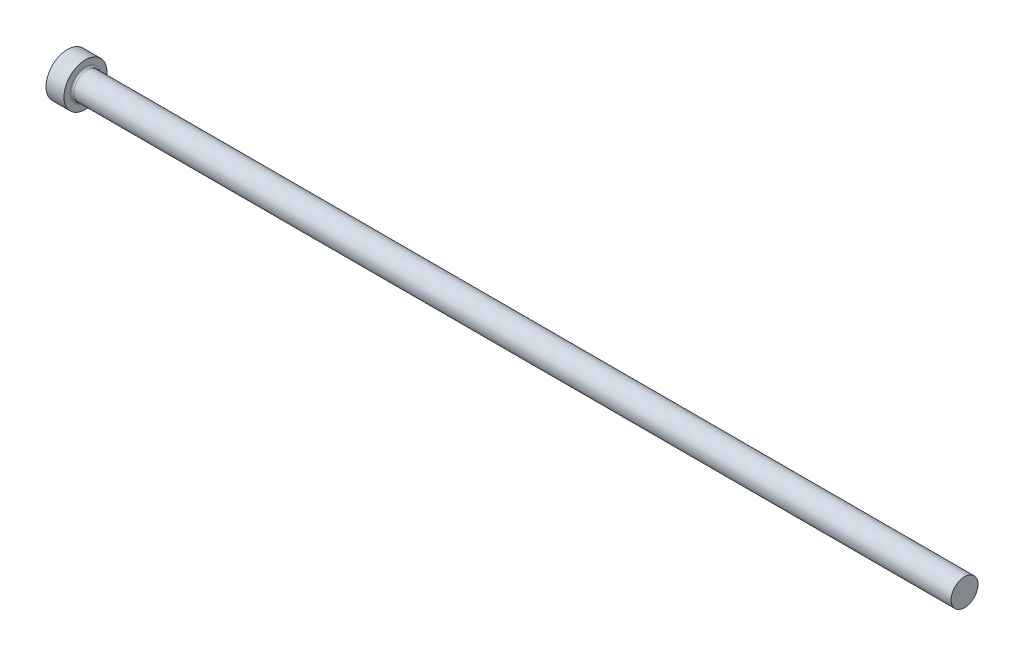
ISO-10303-21;
HEADER;
FILE_DESCRIPTION(('STEP AP214'),'2;1');
FILE_NAME('part.step','',(''),(''),'','','');
FILE_SCHEMA(('AUTOMOTIVE_DESIGN { 1 0 10303 214 1 1 1 1 }'));
ENDSEC;
DATA;
#1=APPLICATION_CONTEXT('core data for automotive mechanical design processes');
#2=APPLICATION_PROTOCOL_DEFINITION('international standard','automotive_design',2000,#1);
#3=PRODUCT_CONTEXT('',#1,'mechanical');
#4=PRODUCT('Part','Part','',(#3));
#5=PRODUCT_RELATED_PRODUCT_CATEGORY('part','',(#4));
#6=PRODUCT_DEFINITION_FORMATION('','',#4);
#7=PRODUCT_DEFINITION_CONTEXT('part definition',#1,'design');
#8=PRODUCT_DEFINITION('design','',#6,#7);
#9=PRODUCT_DEFINITION_SHAPE('','',#8);
#10=(LENGTH_UNIT() NAMED_UNIT(*) SI_UNIT(.MILLI.,.METRE.));
#11=(NAMED_UNIT(*) PLANE_ANGLE_UNIT() SI_UNIT($,.RADIAN.));
#12=(NAMED_UNIT(*) SI_UNIT($,.STERADIAN.) SOLID_ANGLE_UNIT());
#13=UNCERTAINTY_MEASURE_WITH_UNIT(LENGTH_MEASURE(1.E-05),#10,'distance_accuracy_value','');
#14=(GEOMETRIC_REPRESENTATION_CONTEXT(3) GLOBAL_UNCERTAINTY_ASSIGNED_CONTEXT((#13)) GLOBAL_UNIT_ASSIGNED_CONTEXT((#10,
#11,#12)) REPRESENTATION_CONTEXT('',''));
#15=CARTESIAN_POINT('',(0.,0.,0.));
#16=DIRECTION('',(0.,0.,1.));
#17=DIRECTION('',(1.,0.,0.));
#18=AXIS2_PLACEMENT_3D('',#15,#16,#17);
#19=CARTESIAN_POINT('',(0.,0.,0.));
#20=DIRECTION('',(-1.,0.,0.));
#21=DIRECTION('',(0.,-1.,0.));
#22=AXIS2_PLACEMENT_3D('',#19,#20,#21);
#23=PLANE('',#22);
#24=CARTESIAN_POINT('',(0.,0.,0.));
#25=DIRECTION('',(1.,0.,0.));
#26=DIRECTION('',(0.,1.,0.));
#27=AXIS2_PLACEMENT_3D('',#24,#25,#26);
#28=CIRCLE('',#27,6.);
#29=CARTESIAN_POINT('',(0.,6.,0.));
#30=VERTEX_POINT('',#29);
#31=EDGE_CURVE('E25',#30,#30,#28,.T.);
#32=ORIENTED_EDGE('',*,*,#31,.F.);
#33=EDGE_LOOP('',(#32));
#34=FACE_BOUND('',#33,.T.);
#35=ADVANCED_FACE('F14',(#34),#23,.T.);
#36=CARTESIAN_POINT('',(250.,0.,0.));
#37=DIRECTION('',(1.,0.,0.));
#38=DIRECTION('',(0.,1.,0.));
#39=AXIS2_PLACEMENT_3D('',#36,#37,#38);
#40=CYLINDRICAL_SURFACE('',#39,6.);
#41=ORIENTED_EDGE('',*,*,#31,.T.);
#42=EDGE_LOOP('',(#41));
#43=FACE_BOUND('',#42,.T.);
#44=CARTESIAN_POINT('',(5.,0.,0.));
#45=DIRECTION('',(1.,0.,0.));
#46=DIRECTION('',(0.,1.,0.));
#47=AXIS2_PLACEMENT_3D('',#44,#45,#46);
#48=CIRCLE('',#47,6.);
#49=CARTESIAN_POINT('',(5.,6.,0.));
#50=VERTEX_POINT('',#49);
#51=EDGE_CURVE('E29',#50,#50,#48,.T.);
#52=ORIENTED_EDGE('',*,*,#51,.F.);
#53=EDGE_LOOP('',(#52));
#54=FACE_BOUND('',#53,.T.);
#55=ADVANCED_FACE('F51',(#43,#54),#40,.T.);
#56=CARTESIAN_POINT('',(5.,6.,0.));
#57=DIRECTION('',(1.,0.,0.));
#58=DIRECTION('',(0.,1.,0.));
#59=AXIS2_PLACEMENT_3D('',#56,#57,#58);
#60=PLANE('',#59);
#61=CARTESIAN_POINT('',(5.,0.,0.));
#62=DIRECTION('',(1.,0.,0.));
#63=DIRECTION('',(0.,1.,0.));
#64=AXIS2_PLACEMENT_3D('',#61,#62,#63);
#65=CIRCLE('',#64,4.24999999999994);
#66=CARTESIAN_POINT('',(5.,4.24999999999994,0.));
#67=VERTEX_POINT('',#66);
#68=EDGE_CURVE('E9',#67,#67,#65,.F.);
#69=ORIENTED_EDGE('',*,*,#68,.T.);
#70=EDGE_LOOP('',(#69));
#71=FACE_BOUND('',#70,.T.);
#72=ORIENTED_EDGE('',*,*,#51,.T.);
#73=EDGE_LOOP('',(#72));
#74=FACE_BOUND('',#73,.T.);
#75=ADVANCED_FACE('F42',(#71,#74),#60,.T.);
#76=CARTESIAN_POINT('',(250.,0.,0.));
#77=DIRECTION('',(1.,0.,0.));
#78=DIRECTION('',(0.,1.,0.));
#79=AXIS2_PLACEMENT_3D('',#76,#77,#78);
#80=CYLINDRICAL_SURFACE('',#79,3.74999999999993);
#81=CARTESIAN_POINT('',(5.5,0.,0.));
#82=DIRECTION('',(1.,0.,0.));
#83=DIRECTION('',(0.,1.,0.));
#84=AXIS2_PLACEMENT_3D('',#81,#82,#83);
#85=CIRCLE('',#84,3.74999999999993);
#86=CARTESIAN_POINT('',(5.5,3.74999999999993,0.));
#87=VERTEX_POINT('',#86);
#88=EDGE_CURVE('E21',#87,#87,#85,.T.);
#89=ORIENTED_EDGE('',*,*,#88,.T.);
#90=EDGE_LOOP('',(#89));
#91=FACE_BOUND('',#90,.T.);
#92=CARTESIAN_POINT('',(250.,0.,0.));
#93=DIRECTION('',(1.,0.,0.));
#94=DIRECTION('',(0.,1.,0.));
#95=AXIS2_PLACEMENT_3D('',#92,#93,#94);
#96=CIRCLE('',#95,3.75);
#97=CARTESIAN_POINT('',(250.,3.75000000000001,0.));
#98=VERTEX_POINT('',#97);
#99=EDGE_CURVE('E34',#98,#98,#96,.T.);
#100=ORIENTED_EDGE('',*,*,#99,.F.);
#101=EDGE_LOOP('',(#100));
#102=FACE_BOUND('',#101,.T.);
#103=ADVANCED_FACE('F40',(#91,#102),#80,.T.);
#104=CARTESIAN_POINT('',(250.,3.75,0.));
#105=DIRECTION('',(1.,0.,0.));
#106=DIRECTION('',(0.,1.,0.));
#107=AXIS2_PLACEMENT_3D('',#104,#105,#106);
#108=PLANE('',#107);
#109=ORIENTED_EDGE('',*,*,#99,.T.);
#110=EDGE_LOOP('',(#109));
#111=FACE_BOUND('',#110,.T.);
#112=ADVANCED_FACE('F38',(#111),#108,.T.);
#113=CARTESIAN_POINT('',(5.5,0.,0.));
#114=DIRECTION('',(1.,0.,0.));
#115=DIRECTION('',(0.,1.,0.));
#116=AXIS2_PLACEMENT_3D('',#113,#114,#115);
#117=TOROIDAL_SURFACE('',#116,4.24999999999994,0.5);
#118=ORIENTED_EDGE('',*,*,#68,.F.);
#119=EDGE_LOOP('',(#118));
#120=FACE_BOUND('',#119,.T.);
#121=ORIENTED_EDGE('',*,*,#88,.F.);
#122=EDGE_LOOP('',(#121));
#123=FACE_BOUND('',#122,.T.);
#124=ADVANCED_FACE('F16',(#120,#123),#117,.F.);
#125=CLOSED_SHELL('',(#35,#55,#75,#103,#112,#124));
#126=MANIFOLD_SOLID_BREP('B1',#125);
#127=ADVANCED_BREP_SHAPE_REPRESENTATION('',(#18,#126),#14);
#128=SHAPE_DEFINITION_REPRESENTATION(#9,#127);
ENDSEC;
END-ISO-10303-21;
